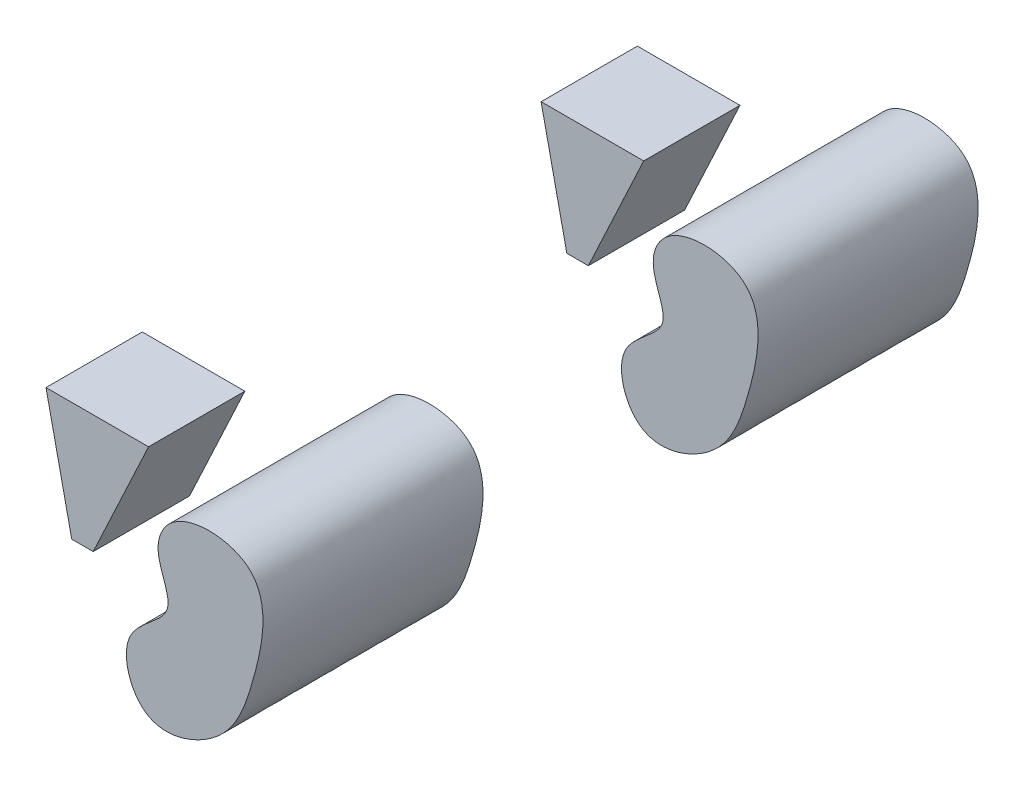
ISO-10303-21;
HEADER;
FILE_DESCRIPTION(('STEP AP214'),'2;1');
FILE_NAME('part.step','',(''),(''),'','','');
FILE_SCHEMA(('AUTOMOTIVE_DESIGN { 1 0 10303 214 1 1 1 1 }'));
ENDSEC;
DATA;
#1=APPLICATION_CONTEXT('core data for automotive mechanical design processes');
#2=APPLICATION_PROTOCOL_DEFINITION('international standard','automotive_design',2000,#1);
#3=PRODUCT_CONTEXT('',#1,'mechanical');
#4=PRODUCT('Part','Part','',(#3));
#5=PRODUCT_RELATED_PRODUCT_CATEGORY('part','',(#4));
#6=PRODUCT_DEFINITION_FORMATION('','',#4);
#7=PRODUCT_DEFINITION_CONTEXT('part definition',#1,'design');
#8=PRODUCT_DEFINITION('design','',#6,#7);
#9=PRODUCT_DEFINITION_SHAPE('','',#8);
#10=(LENGTH_UNIT() NAMED_UNIT(*) SI_UNIT(.MILLI.,.METRE.));
#11=(NAMED_UNIT(*) PLANE_ANGLE_UNIT() SI_UNIT($,.RADIAN.));
#12=(NAMED_UNIT(*) SI_UNIT($,.STERADIAN.) SOLID_ANGLE_UNIT());
#13=UNCERTAINTY_MEASURE_WITH_UNIT(LENGTH_MEASURE(1.E-05),#10,'distance_accuracy_value','');
#14=(GEOMETRIC_REPRESENTATION_CONTEXT(3) GLOBAL_UNCERTAINTY_ASSIGNED_CONTEXT((#13)) GLOBAL_UNIT_ASSIGNED_CONTEXT((#10,
#11,#12)) REPRESENTATION_CONTEXT('',''));
#15=CARTESIAN_POINT('',(0.,0.,0.));
#16=DIRECTION('',(0.,0.,1.));
#17=DIRECTION('',(1.,0.,0.));
#18=AXIS2_PLACEMENT_3D('',#15,#16,#17);
#19=CARTESIAN_POINT('',(-18.7096001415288,86.1423917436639,325.));
#20=DIRECTION('',(0.977216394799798,0.212245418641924,0.));
#21=DIRECTION('',(-0.212245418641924,0.977216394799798,0.));
#22=AXIS2_PLACEMENT_3D('',#19,#20,#21);
#23=PLANE('',#22);
#24=DIRECTION('',(0.212245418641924,-0.977216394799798,0.));
#25=VECTOR('',#24,1.);
#26=CARTESIAN_POINT('',(-18.7096001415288,86.1423917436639,395.));
#27=LINE('',#26,#25);
#28=CARTESIAN_POINT('',(-18.7096001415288,86.1423917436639,395.));
#29=VERTEX_POINT('',#28);
#30=CARTESIAN_POINT('',(0.,0.,395.));
#31=VERTEX_POINT('',#30);
#32=EDGE_CURVE('E119',#29,#31,#27,.T.);
#33=ORIENTED_EDGE('',*,*,#32,.F.);
#34=DIRECTION('',(0.,0.,1.));
#35=VECTOR('',#34,1.);
#36=CARTESIAN_POINT('',(-18.7096001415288,86.1423917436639,325.));
#37=LINE('',#36,#35);
#38=CARTESIAN_POINT('',(-18.7096001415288,86.1423917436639,325.));
#39=VERTEX_POINT('',#38);
#40=EDGE_CURVE('E118',#39,#29,#37,.T.);
#41=ORIENTED_EDGE('',*,*,#40,.F.);
#42=DIRECTION('',(0.212245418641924,-0.977216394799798,0.));
#43=VECTOR('',#42,1.);
#44=CARTESIAN_POINT('',(-18.7096001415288,86.1423917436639,325.));
#45=LINE('',#44,#43);
#46=CARTESIAN_POINT('',(0.,0.,325.));
#47=VERTEX_POINT('',#46);
#48=EDGE_CURVE('E113',#39,#47,#45,.T.);
#49=ORIENTED_EDGE('',*,*,#48,.T.);
#50=DIRECTION('',(0.,0.,1.));
#51=VECTOR('',#50,1.);
#52=CARTESIAN_POINT('',(0.,0.,325.));
#53=LINE('',#52,#51);
#54=EDGE_CURVE('E12',#47,#31,#53,.T.);
#55=ORIENTED_EDGE('',*,*,#54,.T.);
#56=EDGE_LOOP('',(#33,#41,#49,#55));
#57=FACE_BOUND('',#56,.T.);
#58=ADVANCED_FACE('F56',(#57),#23,.F.);
#59=CARTESIAN_POINT('',(0.,0.,325.));
#60=DIRECTION('',(0.,1.,0.));
#61=DIRECTION('',(0.,0.,-1.));
#62=AXIS2_PLACEMENT_3D('',#59,#60,#61);
#63=PLANE('',#62);
#64=DIRECTION('',(1.,0.,0.));
#65=VECTOR('',#64,1.);
#66=CARTESIAN_POINT('',(0.,0.,395.));
#67=LINE('',#66,#65);
#68=CARTESIAN_POINT('',(15.621559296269,0.,395.));
#69=VERTEX_POINT('',#68);
#70=EDGE_CURVE('E121',#31,#69,#67,.T.);
#71=ORIENTED_EDGE('',*,*,#70,.F.);
#72=ORIENTED_EDGE('',*,*,#54,.F.);
#73=DIRECTION('',(1.,0.,0.));
#74=VECTOR('',#73,1.);
#75=CARTESIAN_POINT('',(0.,0.,325.));
#76=LINE('',#75,#74);
#77=CARTESIAN_POINT('',(15.621559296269,0.,325.));
#78=VERTEX_POINT('',#77);
#79=EDGE_CURVE('E97',#47,#78,#76,.T.);
#80=ORIENTED_EDGE('',*,*,#79,.T.);
#81=DIRECTION('',(0.,0.,1.));
#82=VECTOR('',#81,1.);
#83=CARTESIAN_POINT('',(15.621559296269,0.,325.));
#84=LINE('',#83,#82);
#85=EDGE_CURVE('E64',#78,#69,#84,.T.);
#86=ORIENTED_EDGE('',*,*,#85,.T.);
#87=EDGE_LOOP('',(#71,#72,#80,#86));
#88=FACE_BOUND('',#87,.T.);
#89=ADVANCED_FACE('F111',(#88),#63,.F.);
#90=CARTESIAN_POINT('',(15.621559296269,0.,325.));
#91=DIRECTION('',(-0.905931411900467,0.423424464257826,0.));
#92=DIRECTION('',(-0.423424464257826,-0.905931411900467,0.));
#93=AXIS2_PLACEMENT_3D('',#90,#91,#92);
#94=PLANE('',#93);
#95=DIRECTION('',(0.423424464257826,0.905931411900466,0.));
#96=VECTOR('',#95,1.);
#97=CARTESIAN_POINT('',(15.621559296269,0.,395.));
#98=LINE('',#97,#96);
#99=CARTESIAN_POINT('',(55.8837641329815,86.1423917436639,395.));
#100=VERTEX_POINT('',#99);
#101=EDGE_CURVE('E107',#69,#100,#98,.T.);
#102=ORIENTED_EDGE('',*,*,#101,.F.);
#103=ORIENTED_EDGE('',*,*,#85,.F.);
#104=DIRECTION('',(0.423424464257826,0.905931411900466,0.));
#105=VECTOR('',#104,1.);
#106=CARTESIAN_POINT('',(15.621559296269,0.,325.));
#107=LINE('',#106,#105);
#108=CARTESIAN_POINT('',(55.8837641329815,86.1423917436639,325.));
#109=VERTEX_POINT('',#108);
#110=EDGE_CURVE('E100',#78,#109,#107,.T.);
#111=ORIENTED_EDGE('',*,*,#110,.T.);
#112=DIRECTION('',(0.,0.,1.));
#113=VECTOR('',#112,1.);
#114=CARTESIAN_POINT('',(55.8837641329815,86.1423917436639,325.));
#115=LINE('',#114,#113);
#116=EDGE_CURVE('E110',#109,#100,#115,.T.);
#117=ORIENTED_EDGE('',*,*,#116,.T.);
#118=EDGE_LOOP('',(#102,#103,#111,#117));
#119=FACE_BOUND('',#118,.T.);
#120=ADVANCED_FACE('F106',(#119),#94,.F.);
#121=CARTESIAN_POINT('',(55.8837641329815,86.1423917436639,325.));
#122=DIRECTION('',(0.,-1.,0.));
#123=DIRECTION('',(0.,0.,1.));
#124=AXIS2_PLACEMENT_3D('',#121,#122,#123);
#125=PLANE('',#124);
#126=DIRECTION('',(-1.,0.,0.));
#127=VECTOR('',#126,1.);
#128=CARTESIAN_POINT('',(55.8837641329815,86.1423917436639,395.));
#129=LINE('',#128,#127);
#130=EDGE_CURVE('E86',#100,#29,#129,.T.);
#131=ORIENTED_EDGE('',*,*,#130,.F.);
#132=ORIENTED_EDGE('',*,*,#116,.F.);
#133=DIRECTION('',(-1.,0.,0.));
#134=VECTOR('',#133,1.);
#135=CARTESIAN_POINT('',(55.8837641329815,86.1423917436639,325.));
#136=LINE('',#135,#134);
#137=EDGE_CURVE('E72',#109,#39,#136,.T.);
#138=ORIENTED_EDGE('',*,*,#137,.T.);
#139=ORIENTED_EDGE('',*,*,#40,.T.);
#140=EDGE_LOOP('',(#131,#132,#138,#139));
#141=FACE_BOUND('',#140,.T.);
#142=ADVANCED_FACE('F130',(#141),#125,.F.);
#143=CARTESIAN_POINT('',(0.,0.,325.));
#144=DIRECTION('',(0.,0.,-1.));
#145=DIRECTION('',(1.,0.,0.));
#146=AXIS2_PLACEMENT_3D('',#143,#144,#145);
#147=PLANE('',#146);
#148=ORIENTED_EDGE('',*,*,#48,.F.);
#149=ORIENTED_EDGE('',*,*,#137,.F.);
#150=ORIENTED_EDGE('',*,*,#110,.F.);
#151=ORIENTED_EDGE('',*,*,#79,.F.);
#152=EDGE_LOOP('',(#148,#149,#150,#151));
#153=FACE_BOUND('',#152,.T.);
#154=ADVANCED_FACE('F102',(#153),#147,.T.);
#155=CARTESIAN_POINT('',(0.,0.,395.));
#156=DIRECTION('',(0.,0.,-1.));
#157=DIRECTION('',(1.,0.,0.));
#158=AXIS2_PLACEMENT_3D('',#155,#156,#157);
#159=PLANE('',#158);
#160=ORIENTED_EDGE('',*,*,#32,.T.);
#161=ORIENTED_EDGE('',*,*,#70,.T.);
#162=ORIENTED_EDGE('',*,*,#101,.T.);
#163=ORIENTED_EDGE('',*,*,#130,.T.);
#164=EDGE_LOOP('',(#160,#161,#162,#163));
#165=FACE_BOUND('',#164,.T.);
#166=ADVANCED_FACE('F126',(#165),#159,.F.);
#167=CLOSED_SHELL('',(#58,#89,#120,#142,#154,#166));
#168=MANIFOLD_SOLID_BREP('B2',#167);
#169=CARTESIAN_POINT('',(99.5806619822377,-37.7575473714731,280.));
#170=CARTESIAN_POINT('',(113.687056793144,-46.7528870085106,280.));
#171=CARTESIAN_POINT('',(159.35495643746,-29.7950940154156,280.));
#172=CARTESIAN_POINT('',(178.512602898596,22.1480939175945,280.));
#173=CARTESIAN_POINT('',(195.636063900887,102.403921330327,280.));
#174=CARTESIAN_POINT('',(118.203317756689,104.130129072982,280.));
#175=CARTESIAN_POINT('',(102.985048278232,65.7645388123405,280.));
#176=CARTESIAN_POINT('',(127.059717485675,31.3112046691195,280.));
#177=CARTESIAN_POINT('',(74.5528879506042,11.0094779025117,280.));
#178=CARTESIAN_POINT('',(87.1271684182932,-29.8162267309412,280.));
#179=CARTESIAN_POINT('',(99.5806619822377,-37.7575473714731,280.));
#180=B_SPLINE_CURVE_WITH_KNOTS('',3,(#169,#170,#171,#172,#173,#174,#175,#176,#177,#178,#179),
.UNSPECIFIED.,.T.,.F.,(4,1,1,1,1,1,1,1,4),(0.,0.13536265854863,0.284937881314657,
0.470074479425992,0.624543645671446,0.680714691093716,0.770204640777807,0.880498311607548,1.),.UNSPECIFIED.);
#181=DIRECTION('',(0.,0.,1.));
#182=VECTOR('',#181,1.);
#183=SURFACE_OF_LINEAR_EXTRUSION('',#180,#182);
#184=CARTESIAN_POINT('',(99.5806619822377,-37.7575473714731,280.));
#185=VERTEX_POINT('',#184);
#186=EDGE_CURVE('E55',#185,#185,#180,.T.);
#187=ORIENTED_EDGE('',*,*,#186,.T.);
#188=EDGE_LOOP('',(#187));
#189=FACE_BOUND('',#188,.T.);
#190=CARTESIAN_POINT('',(99.5806619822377,-37.7575473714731,440.));
#191=CARTESIAN_POINT('',(113.687056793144,-46.7528870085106,440.));
#192=CARTESIAN_POINT('',(159.35495643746,-29.7950940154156,440.));
#193=CARTESIAN_POINT('',(178.512602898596,22.1480939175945,440.));
#194=CARTESIAN_POINT('',(195.636063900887,102.403921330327,440.));
#195=CARTESIAN_POINT('',(118.203317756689,104.130129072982,440.));
#196=CARTESIAN_POINT('',(102.985048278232,65.7645388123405,440.));
#197=CARTESIAN_POINT('',(127.059717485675,31.3112046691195,440.));
#198=CARTESIAN_POINT('',(74.5528879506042,11.0094779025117,440.));
#199=CARTESIAN_POINT('',(87.1271684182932,-29.8162267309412,440.));
#200=CARTESIAN_POINT('',(99.5806619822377,-37.7575473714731,440.));
#201=B_SPLINE_CURVE_WITH_KNOTS('',3,(#190,#191,#192,#193,#194,#195,#196,#197,#198,#199,#200),
.UNSPECIFIED.,.T.,.F.,(4,1,1,1,1,1,1,1,4),(0.,0.13536265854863,0.284937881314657,
0.470074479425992,0.624543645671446,0.680714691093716,0.770204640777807,0.880498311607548,1.),.UNSPECIFIED.);
#202=CARTESIAN_POINT('',(99.5806619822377,-37.7575473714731,440.));
#203=VERTEX_POINT('',#202);
#204=EDGE_CURVE('E192',#203,#203,#201,.T.);
#205=ORIENTED_EDGE('',*,*,#204,.F.);
#206=EDGE_LOOP('',(#205));
#207=FACE_BOUND('',#206,.T.);
#208=ADVANCED_FACE('F188',(#189,#207),#183,.T.);
#209=CARTESIAN_POINT('',(163.697023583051,96.939343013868,280.));
#210=DIRECTION('',(0.,0.,-1.));
#211=DIRECTION('',(1.,0.,0.));
#212=AXIS2_PLACEMENT_3D('',#209,#210,#211);
#213=PLANE('',#212);
#214=ORIENTED_EDGE('',*,*,#186,.F.);
#215=EDGE_LOOP('',(#214));
#216=FACE_BOUND('',#215,.T.);
#217=ADVANCED_FACE('F211',(#216),#213,.T.);
#218=CARTESIAN_POINT('',(163.697023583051,96.939343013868,440.));
#219=DIRECTION('',(0.,0.,-1.));
#220=DIRECTION('',(1.,0.,0.));
#221=AXIS2_PLACEMENT_3D('',#218,#219,#220);
#222=PLANE('',#221);
#223=ORIENTED_EDGE('',*,*,#204,.T.);
#224=EDGE_LOOP('',(#223));
#225=FACE_BOUND('',#224,.T.);
#226=ADVANCED_FACE('F208',(#225),#222,.F.);
#227=CLOSED_SHELL('',(#208,#217,#226));
#228=MANIFOLD_SOLID_BREP('B6',#227);
#229=CARTESIAN_POINT('',(99.5806619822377,-37.7575473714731,80.));
#230=CARTESIAN_POINT('',(113.687056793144,-46.7528870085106,80.));
#231=CARTESIAN_POINT('',(159.35495643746,-29.7950940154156,80.));
#232=CARTESIAN_POINT('',(178.512602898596,22.1480939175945,80.));
#233=CARTESIAN_POINT('',(195.636063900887,102.403921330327,80.));
#234=CARTESIAN_POINT('',(118.203317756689,104.130129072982,80.));
#235=CARTESIAN_POINT('',(102.985048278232,65.7645388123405,80.));
#236=CARTESIAN_POINT('',(127.059717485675,31.3112046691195,80.));
#237=CARTESIAN_POINT('',(74.5528879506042,11.0094779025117,80.));
#238=CARTESIAN_POINT('',(87.1271684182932,-29.8162267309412,80.));
#239=CARTESIAN_POINT('',(99.5806619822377,-37.7575473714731,80.));
#240=B_SPLINE_CURVE_WITH_KNOTS('',3,(#229,#230,#231,#232,#233,#234,#235,#236,#237,#238,#239),
.UNSPECIFIED.,.T.,.F.,(4,1,1,1,1,1,1,1,4),(0.,0.13536265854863,0.284937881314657,
0.470074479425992,0.624543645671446,0.680714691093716,0.770204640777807,0.880498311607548,1.),.UNSPECIFIED.);
#241=DIRECTION('',(0.,0.,-1.));
#242=VECTOR('',#241,1.);
#243=SURFACE_OF_LINEAR_EXTRUSION('',#240,#242);
#244=CARTESIAN_POINT('',(99.5806619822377,-37.7575473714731,80.));
#245=VERTEX_POINT('',#244);
#246=EDGE_CURVE('E187',#245,#245,#240,.T.);
#247=ORIENTED_EDGE('',*,*,#246,.F.);
#248=EDGE_LOOP('',(#247));
#249=FACE_BOUND('',#248,.T.);
#250=CARTESIAN_POINT('',(99.5806619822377,-37.7575473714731,-80.));
#251=CARTESIAN_POINT('',(113.687056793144,-46.7528870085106,-80.));
#252=CARTESIAN_POINT('',(159.35495643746,-29.7950940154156,-80.));
#253=CARTESIAN_POINT('',(178.512602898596,22.1480939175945,-80.));
#254=CARTESIAN_POINT('',(195.636063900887,102.403921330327,-80.));
#255=CARTESIAN_POINT('',(118.203317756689,104.130129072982,-80.));
#256=CARTESIAN_POINT('',(102.985048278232,65.7645388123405,-80.));
#257=CARTESIAN_POINT('',(127.059717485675,31.3112046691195,-80.));
#258=CARTESIAN_POINT('',(74.5528879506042,11.0094779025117,-80.));
#259=CARTESIAN_POINT('',(87.1271684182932,-29.8162267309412,-80.));
#260=CARTESIAN_POINT('',(99.5806619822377,-37.7575473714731,-80.));
#261=B_SPLINE_CURVE_WITH_KNOTS('',3,(#250,#251,#252,#253,#254,#255,#256,#257,#258,#259,#260),
.UNSPECIFIED.,.T.,.F.,(4,1,1,1,1,1,1,1,4),(0.,0.13536265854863,0.284937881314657,
0.470074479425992,0.624543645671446,0.680714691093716,0.770204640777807,0.880498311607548,1.),.UNSPECIFIED.);
#262=CARTESIAN_POINT('',(99.5806619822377,-37.7575473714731,-80.));
#263=VERTEX_POINT('',#262);
#264=EDGE_CURVE('E253',#263,#263,#261,.T.);
#265=ORIENTED_EDGE('',*,*,#264,.T.);
#266=EDGE_LOOP('',(#265));
#267=FACE_BOUND('',#266,.T.);
#268=ADVANCED_FACE('F249',(#249,#267),#243,.F.);
#269=CARTESIAN_POINT('',(163.697023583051,96.939343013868,80.));
#270=DIRECTION('',(0.,0.,1.));
#271=DIRECTION('',(1.,0.,0.));
#272=AXIS2_PLACEMENT_3D('',#269,#270,#271);
#273=PLANE('',#272);
#274=ORIENTED_EDGE('',*,*,#246,.T.);
#275=EDGE_LOOP('',(#274));
#276=FACE_BOUND('',#275,.T.);
#277=ADVANCED_FACE('F274',(#276),#273,.T.);
#278=CARTESIAN_POINT('',(163.697023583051,96.939343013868,-80.));
#279=DIRECTION('',(0.,0.,1.));
#280=DIRECTION('',(1.,0.,0.));
#281=AXIS2_PLACEMENT_3D('',#278,#279,#280);
#282=PLANE('',#281);
#283=ORIENTED_EDGE('',*,*,#264,.F.);
#284=EDGE_LOOP('',(#283));
#285=FACE_BOUND('',#284,.T.);
#286=ADVANCED_FACE('F272',(#285),#282,.F.);
#287=CLOSED_SHELL('',(#268,#277,#286));
#288=MANIFOLD_SOLID_BREP('B50',#287);
#289=CARTESIAN_POINT('',(-18.7096001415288,86.1423917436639,35.));
#290=DIRECTION('',(0.977216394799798,0.212245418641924,0.));
#291=DIRECTION('',(-0.212245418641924,0.977216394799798,0.));
#292=AXIS2_PLACEMENT_3D('',#289,#290,#291);
#293=PLANE('',#292);
#294=DIRECTION('',(0.212245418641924,-0.977216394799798,0.));
#295=VECTOR('',#294,1.);
#296=CARTESIAN_POINT('',(-18.7096001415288,86.1423917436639,-35.));
#297=LINE('',#296,#295);
#298=CARTESIAN_POINT('',(-18.7096001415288,86.1423917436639,-35.));
#299=VERTEX_POINT('',#298);
#300=CARTESIAN_POINT('',(0.,0.,-35.));
#301=VERTEX_POINT('',#300);
#302=EDGE_CURVE('E360',#299,#301,#297,.T.);
#303=ORIENTED_EDGE('',*,*,#302,.T.);
#304=DIRECTION('',(0.,0.,-1.));
#305=VECTOR('',#304,1.);
#306=CARTESIAN_POINT('',(0.,0.,35.));
#307=LINE('',#306,#305);
#308=CARTESIAN_POINT('',(0.,0.,35.));
#309=VERTEX_POINT('',#308);
#310=EDGE_CURVE('E247',#309,#301,#307,.T.);
#311=ORIENTED_EDGE('',*,*,#310,.F.);
#312=DIRECTION('',(0.212245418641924,-0.977216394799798,0.));
#313=VECTOR('',#312,1.);
#314=CARTESIAN_POINT('',(-18.7096001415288,86.1423917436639,35.));
#315=LINE('',#314,#313);
#316=CARTESIAN_POINT('',(-18.7096001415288,86.1423917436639,35.));
#317=VERTEX_POINT('',#316);
#318=EDGE_CURVE('E348',#317,#309,#315,.T.);
#319=ORIENTED_EDGE('',*,*,#318,.F.);
#320=DIRECTION('',(0.,0.,-1.));
#321=VECTOR('',#320,1.);
#322=CARTESIAN_POINT('',(-18.7096001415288,86.1423917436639,35.));
#323=LINE('',#322,#321);
#324=EDGE_CURVE('E356',#317,#299,#323,.T.);
#325=ORIENTED_EDGE('',*,*,#324,.T.);
#326=EDGE_LOOP('',(#303,#311,#319,#325));
#327=FACE_BOUND('',#326,.T.);
#328=ADVANCED_FACE('F297',(#327),#293,.F.);
#329=CARTESIAN_POINT('',(0.,0.,35.));
#330=DIRECTION('',(0.,1.,0.));
#331=DIRECTION('',(0.,0.,1.));
#332=AXIS2_PLACEMENT_3D('',#329,#330,#331);
#333=PLANE('',#332);
#334=DIRECTION('',(1.,0.,0.));
#335=VECTOR('',#334,1.);
#336=CARTESIAN_POINT('',(0.,0.,-35.));
#337=LINE('',#336,#335);
#338=CARTESIAN_POINT('',(15.621559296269,0.,-35.));
#339=VERTEX_POINT('',#338);
#340=EDGE_CURVE('E352',#301,#339,#337,.T.);
#341=ORIENTED_EDGE('',*,*,#340,.T.);
#342=DIRECTION('',(0.,0.,-1.));
#343=VECTOR('',#342,1.);
#344=CARTESIAN_POINT('',(15.621559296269,0.,35.));
#345=LINE('',#344,#343);
#346=CARTESIAN_POINT('',(15.621559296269,0.,35.));
#347=VERTEX_POINT('',#346);
#348=EDGE_CURVE('E305',#347,#339,#345,.T.);
#349=ORIENTED_EDGE('',*,*,#348,.F.);
#350=DIRECTION('',(1.,0.,0.));
#351=VECTOR('',#350,1.);
#352=CARTESIAN_POINT('',(0.,0.,35.));
#353=LINE('',#352,#351);
#354=EDGE_CURVE('E343',#309,#347,#353,.T.);
#355=ORIENTED_EDGE('',*,*,#354,.F.);
#356=ORIENTED_EDGE('',*,*,#310,.T.);
#357=EDGE_LOOP('',(#341,#349,#355,#356));
#358=FACE_BOUND('',#357,.T.);
#359=ADVANCED_FACE('F351',(#358),#333,.F.);
#360=CARTESIAN_POINT('',(15.621559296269,0.,35.));
#361=DIRECTION('',(-0.905931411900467,0.423424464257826,0.));
#362=DIRECTION('',(-0.423424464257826,-0.905931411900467,0.));
#363=AXIS2_PLACEMENT_3D('',#360,#361,#362);
#364=PLANE('',#363);
#365=DIRECTION('',(0.423424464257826,0.905931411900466,0.));
#366=VECTOR('',#365,1.);
#367=CARTESIAN_POINT('',(15.621559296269,0.,-35.));
#368=LINE('',#367,#366);
#369=CARTESIAN_POINT('',(55.8837641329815,86.1423917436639,-35.));
#370=VERTEX_POINT('',#369);
#371=EDGE_CURVE('E330',#339,#370,#368,.T.);
#372=ORIENTED_EDGE('',*,*,#371,.T.);
#373=DIRECTION('',(0.,0.,-1.));
#374=VECTOR('',#373,1.);
#375=CARTESIAN_POINT('',(55.8837641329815,86.1423917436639,35.));
#376=LINE('',#375,#374);
#377=CARTESIAN_POINT('',(55.8837641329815,86.1423917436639,35.));
#378=VERTEX_POINT('',#377);
#379=EDGE_CURVE('E353',#378,#370,#376,.T.);
#380=ORIENTED_EDGE('',*,*,#379,.F.);
#381=DIRECTION('',(0.423424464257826,0.905931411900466,0.));
#382=VECTOR('',#381,1.);
#383=CARTESIAN_POINT('',(15.621559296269,0.,35.));
#384=LINE('',#383,#382);
#385=EDGE_CURVE('E346',#347,#378,#384,.T.);
#386=ORIENTED_EDGE('',*,*,#385,.F.);
#387=ORIENTED_EDGE('',*,*,#348,.T.);
#388=EDGE_LOOP('',(#372,#380,#386,#387));
#389=FACE_BOUND('',#388,.T.);
#390=ADVANCED_FACE('F354',(#389),#364,.F.);
#391=CARTESIAN_POINT('',(55.8837641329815,86.1423917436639,35.));
#392=DIRECTION('',(0.,-1.,0.));
#393=DIRECTION('',(0.,0.,-1.));
#394=AXIS2_PLACEMENT_3D('',#391,#392,#393);
#395=PLANE('',#394);
#396=DIRECTION('',(-1.,0.,0.));
#397=VECTOR('',#396,1.);
#398=CARTESIAN_POINT('',(55.8837641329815,86.1423917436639,-35.));
#399=LINE('',#398,#397);
#400=EDGE_CURVE('E336',#370,#299,#399,.T.);
#401=ORIENTED_EDGE('',*,*,#400,.T.);
#402=ORIENTED_EDGE('',*,*,#324,.F.);
#403=DIRECTION('',(-1.,0.,0.));
#404=VECTOR('',#403,1.);
#405=CARTESIAN_POINT('',(55.8837641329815,86.1423917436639,35.));
#406=LINE('',#405,#404);
#407=EDGE_CURVE('E313',#378,#317,#406,.T.);
#408=ORIENTED_EDGE('',*,*,#407,.F.);
#409=ORIENTED_EDGE('',*,*,#379,.T.);
#410=EDGE_LOOP('',(#401,#402,#408,#409));
#411=FACE_BOUND('',#410,.T.);
#412=ADVANCED_FACE('F367',(#411),#395,.F.);
#413=CARTESIAN_POINT('',(0.,0.,35.));
#414=DIRECTION('',(0.,0.,1.));
#415=DIRECTION('',(1.,0.,0.));
#416=AXIS2_PLACEMENT_3D('',#413,#414,#415);
#417=PLANE('',#416);
#418=ORIENTED_EDGE('',*,*,#318,.T.);
#419=ORIENTED_EDGE('',*,*,#354,.T.);
#420=ORIENTED_EDGE('',*,*,#385,.T.);
#421=ORIENTED_EDGE('',*,*,#407,.T.);
#422=EDGE_LOOP('',(#418,#419,#420,#421));
#423=FACE_BOUND('',#422,.T.);
#424=ADVANCED_FACE('F344',(#423),#417,.T.);
#425=CARTESIAN_POINT('',(0.,0.,-35.));
#426=DIRECTION('',(0.,0.,1.));
#427=DIRECTION('',(1.,0.,0.));
#428=AXIS2_PLACEMENT_3D('',#425,#426,#427);
#429=PLANE('',#428);
#430=ORIENTED_EDGE('',*,*,#302,.F.);
#431=ORIENTED_EDGE('',*,*,#400,.F.);
#432=ORIENTED_EDGE('',*,*,#371,.F.);
#433=ORIENTED_EDGE('',*,*,#340,.F.);
#434=EDGE_LOOP('',(#430,#431,#432,#433));
#435=FACE_BOUND('',#434,.T.);
#436=ADVANCED_FACE('F370',(#435),#429,.F.);
#437=CLOSED_SHELL('',(#328,#359,#390,#412,#424,#436));
#438=MANIFOLD_SOLID_BREP('B182',#437);
#439=ADVANCED_BREP_SHAPE_REPRESENTATION('',(#18,#168,#228,#288,#438),#14);
#440=SHAPE_DEFINITION_REPRESENTATION(#9,#439);
ENDSEC;
END-ISO-10303-21;
